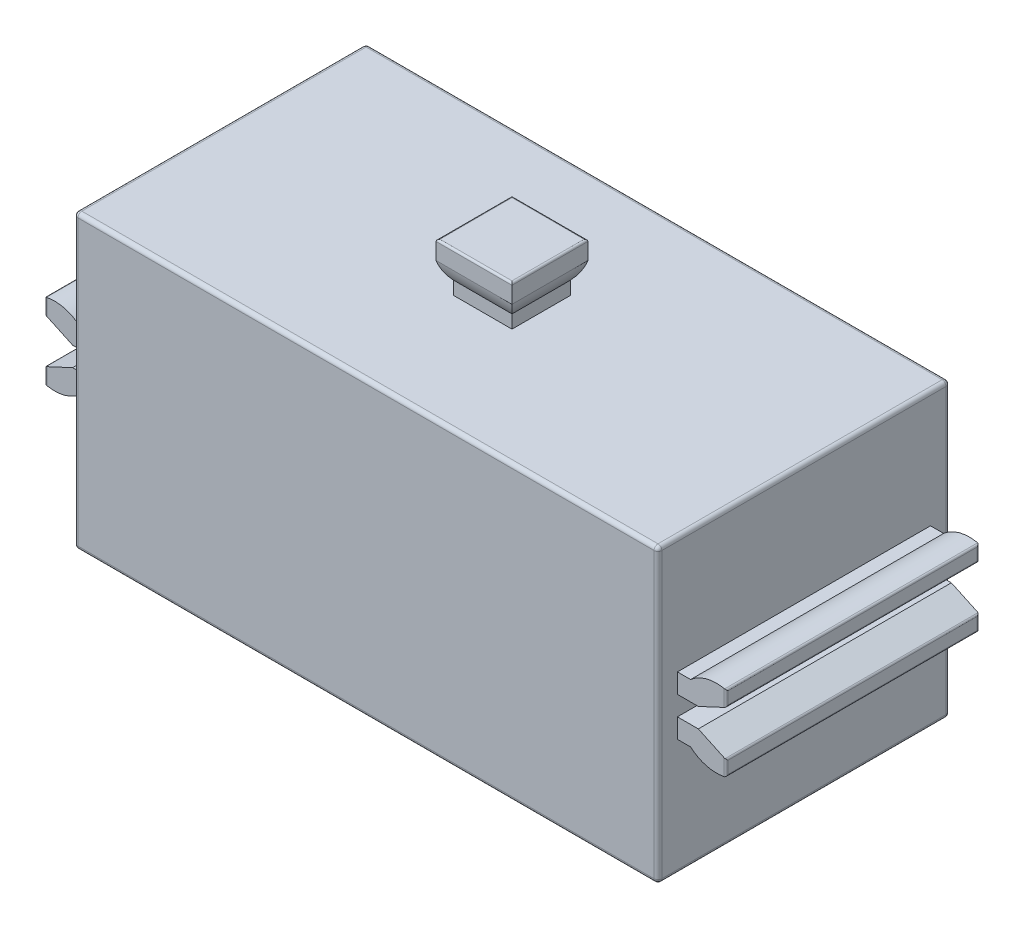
from build123d import *

# Parameters (mm, degrees)
EXTRUDE_1_DEPTH      = 7.5
EXTRUDE_1_DEPTH_BACK = 7.5
SKETCH_1_W           = 30
SKETCH_1_H           = 15
EXTRUDE_START        = -1
EXTRUDE_2_DEPTH      = 13
SKETCH_3_W           = 3
SKETCH_3_H           = 3
EXTRUDE_3_DEPTH      = 1
EXTRUDE_4_DEPTH      = 2
EXTRUDE_4_DEPTH_BACK = 3
CUT_EXTRUDE_1_REACH  = 25.12
FILLET_1_R           = 0.1
FILLET_2_R           = 0.2
SKETCH_6_R           = 1.7
CUT_EXTRUDE_2_DEPTH  = 1


with BuildPart() as part:
    # Sketch 1 → Extrude 1 (new, two sides: drawn at the far end of the back side and taken through both)
    with BuildSketch(Plane.XY.offset(-EXTRUDE_1_DEPTH_BACK)):
        Rectangle(SKETCH_1_W, SKETCH_1_H)
    extrude(amount=EXTRUDE_1_DEPTH + EXTRUDE_1_DEPTH_BACK)

    # Sketch 2 → Extrude 2 (add)
    with BuildSketch(Plane.XY.offset(7.5).offset(EXTRUDE_START)):
        with BuildLine():
            Line((-15.677124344, 1.5), (-15, 1.5))
            Line((-15, 1.5), (-15, 0.5))
            Line((-15, 0.5), (-16.07225346, 0.5))
            Line((-16.07225346, 0.5), (-17.5, 1.165769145))
            Line((-17.5, 1.165769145), (-17.5, 1.936491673))
            ThreePointArc((-17.5, 1.936491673), (-16.53426152, 1.94501611), (-15.677124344, 1.5))
        make_face()
        with BuildLine():
            Line((-15.677124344, -1.5), (-15, -1.5))
            Line((-15, -1.5), (-15, -0.5))
            Line((-15, -0.5), (-16.07225346, -0.5))
            Line((-16.07225346, -0.5), (-17.5, -1.165769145))
            Line((-17.5, -1.165769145), (-17.5, -1.936491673))
            ThreePointArc((-17.5, -1.936491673), (-16.53426152, -1.94501611), (-15.677124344, -1.5))
        make_face()
        with BuildLine():
            Line((15, -0.5), (15, -1.5))
            Line((15, -1.5), (15.677124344, -1.5))
            ThreePointArc((15.677124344, -1.5), (16.53426152, -1.94501611), (17.5, -1.936491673))
            Line((17.5, -1.936491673), (17.5, -1.165769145))
            Line((17.5, -1.165769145), (16.07225346, -0.5))
            Line((16.07225346, -0.5), (15, -0.5))
        make_face()
        with BuildLine():
            Line((15, 0.5), (16.07225346, 0.5))
            Line((16.07225346, 0.5), (17.5, 1.165769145))
            Line((17.5, 1.165769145), (17.5, 1.936491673))
            ThreePointArc((17.5, 1.936491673), (16.53426152, 1.94501611), (15.677124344, 1.5))
            Line((15.677124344, 1.5), (15, 1.5))
            Line((15, 1.5), (15, 0.5))
        make_face()
    extrude(amount=-EXTRUDE_2_DEPTH)

    # Sketch 3 → Extrude 3 (add)
    with BuildSketch(Plane(origin=(0, 7.5, 0), x_dir=(-1, 0, 0), z_dir=(0, 1, 0))):
        Rectangle(SKETCH_3_W, SKETCH_3_H)
    extrude(amount=EXTRUDE_3_DEPTH)

    # Sketch 4 → Extrude 4 (add, two sides: drawn at the far end of the back side and taken through both)
    with BuildSketch(Plane.XY.offset(-EXTRUDE_4_DEPTH_BACK)):
        with BuildLine():
            Line((-1.95, 10), (1.95, 10))
            Line((1.95, 10), (1.95, 9.055590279))
            ThreePointArc((1.95, 9.055590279), (1.780042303, 8.588161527), (1.5, 8.177124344))
            Line((1.5, 8.177124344), (-1.5, 8.177124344))
            ThreePointArc((-1.5, 8.177124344), (-1.780042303, 8.588161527), (-1.95, 9.055590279))
            Line((-1.95, 9.055590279), (-1.95, 10))
        make_face()
    extrude(amount=EXTRUDE_4_DEPTH + EXTRUDE_4_DEPTH_BACK)

    # Sketch 5 → Cut-Extrude 1 (cut, up to next)
    with BuildSketch(Plane(origin=(1.95, 0, 0), x_dir=(0, 0, -1), z_dir=(1, 0, 0)), mode=Mode.PRIVATE) as cut_extrude_1_sk1:
        with BuildLine():
            Line((-1.95, 10), (-1.95, 9.055590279))
            ThreePointArc((-1.95, 9.055590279), (-1.780042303, 8.588161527), (-1.5, 8.177124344))
            Line((-1.5, 8.177124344), (-2, 8.177124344))
            Line((-2, 8.177124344), (-2, 10))
            Line((-2, 10), (-1.95, 10))
        make_face()
    cut_extrude_1_tool1 = extrude(cut_extrude_1_sk1.sketch, amount=-CUT_EXTRUDE_1_REACH, mode=Mode.PRIVATE) & part.part
    # Sketch 5 → Cut-Extrude 1 (cut, up to next)
    with BuildSketch(Plane(origin=(1.95, 0, 0), x_dir=(0, 0, -1), z_dir=(1, 0, 0)), mode=Mode.PRIVATE) as cut_extrude_1_sk2:
        with BuildLine():
            Line((3, 10), (3, 8.177124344))
            Line((3, 8.177124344), (1.5, 8.177124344))
            ThreePointArc((1.5, 8.177124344), (1.780042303, 8.588161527), (1.95, 9.055590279))
            Line((1.95, 9.055590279), (1.95, 10))
            Line((1.95, 10), (3, 10))
        make_face()
    cut_extrude_1_tool2 = extrude(cut_extrude_1_sk2.sketch, amount=-CUT_EXTRUDE_1_REACH, mode=Mode.PRIVATE) & part.part
    add(cut_extrude_1_tool1.solids().sort_by_distance((1.95, 8.675075, 1.873038))[0], mode=Mode.SUBTRACT)
    add(cut_extrude_1_tool2.solids().sort_by_distance((1.95, 9.039049, -2.424924))[0], mode=Mode.SUBTRACT)

    # Fillet 1
    fillet_1_edges = [part.edges().sort_by_distance(p)[0] for p in [
        (0, 10, 1.95),
        (1.95, 10, 0),
        (-1.95, 10, 0),
        (0, 10, -1.95),
        (-17.5, -1.551130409, -6.5),
        (-17.5, -1.936491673, 0),
        (-17.5, -1.165769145, 0),
        (-17.5, -1.551130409, 6.5),
        (-17.5, 1.551130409, -6.5),
        (-17.5, 1.165769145, 0),
        (-17.5, 1.936491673, 0),
        (-17.5, 1.551130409, 6.5),
        (17.5, -1.936491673, 0),
        (17.5, -1.551130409, -6.5),
        (17.5, -1.165769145, 0),
        (17.5, -1.551130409, 6.5),
        (17.5, 1.551130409, -6.5),
        (17.5, 1.936491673, 0),
        (17.5, 1.165769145, 0),
        (17.5, 1.551130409, 6.5),
    ]]
    fillet(fillet_1_edges, radius=FILLET_1_R)

    # Fillet 2
    fillet_2_edges = [part.edges().sort_by_distance(p)[0] for p in [
        (15, 0, -7.5),
        (-15, 0, 7.5),
        (0, -7.5, 7.5),
        (0, 7.5, -7.5),
        (15, 0, 7.5),
        (0, 7.5, 7.5),
        (-15, 0, -7.5),
        (0, -7.5, -7.5),
        (-15, 7.5, 0),
        (15, 7.5, 0),
        (15, -7.5, 0),
        (-15, -7.5, 0),
    ]]
    fillet(fillet_2_edges, radius=FILLET_2_R)

    # Sketch 6 → Cut-Extrude 2 (cut)
    with BuildSketch(Plane.XZ.offset(7.5)):
        with Locations(Location((-2.8, 0, 0), (0, 0, 270))):
            Circle(SKETCH_6_R)
    cut_extrude_2 = extrude(amount=-CUT_EXTRUDE_2_DEPTH, mode=Mode.SUBTRACT)

    # Mirror 2: Cut-Extrude 2 across plane
    add(cut_extrude_2.mirror(Plane(origin=(0, 0, 0), x_dir=(0, 0, 1), z_dir=(1, 0, 0))), mode=Mode.SUBTRACT)


solid = part.part
